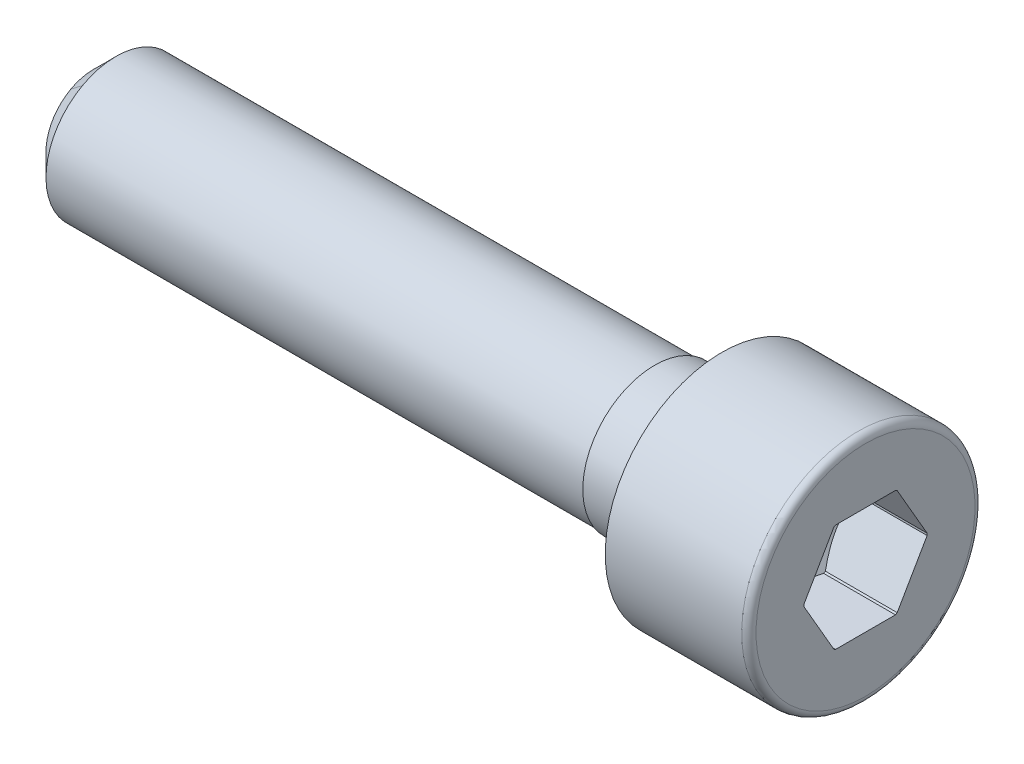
ISO-10303-21;
HEADER;
FILE_DESCRIPTION(('STEP AP214'),'2;1');
FILE_NAME('part.step','',(''),(''),'','','');
FILE_SCHEMA(('AUTOMOTIVE_DESIGN { 1 0 10303 214 1 1 1 1 }'));
ENDSEC;
DATA;
#1=APPLICATION_CONTEXT('core data for automotive mechanical design processes');
#2=APPLICATION_PROTOCOL_DEFINITION('international standard','automotive_design',2000,#1);
#3=PRODUCT_CONTEXT('',#1,'mechanical');
#4=PRODUCT('Part','Part','',(#3));
#5=PRODUCT_RELATED_PRODUCT_CATEGORY('part','',(#4));
#6=PRODUCT_DEFINITION_FORMATION('','',#4);
#7=PRODUCT_DEFINITION_CONTEXT('part definition',#1,'design');
#8=PRODUCT_DEFINITION('design','',#6,#7);
#9=PRODUCT_DEFINITION_SHAPE('','',#8);
#10=(LENGTH_UNIT() NAMED_UNIT(*) SI_UNIT(.MILLI.,.METRE.));
#11=(NAMED_UNIT(*) PLANE_ANGLE_UNIT() SI_UNIT($,.RADIAN.));
#12=(NAMED_UNIT(*) SI_UNIT($,.STERADIAN.) SOLID_ANGLE_UNIT());
#13=UNCERTAINTY_MEASURE_WITH_UNIT(LENGTH_MEASURE(1.E-05),#10,'distance_accuracy_value','');
#14=(GEOMETRIC_REPRESENTATION_CONTEXT(3) GLOBAL_UNCERTAINTY_ASSIGNED_CONTEXT((#13)) GLOBAL_UNIT_ASSIGNED_CONTEXT((#10,
#11,#12)) REPRESENTATION_CONTEXT('',''));
#15=CARTESIAN_POINT('',(0.,0.,0.));
#16=DIRECTION('',(0.,0.,1.));
#17=DIRECTION('',(1.,0.,0.));
#18=AXIS2_PLACEMENT_3D('',#15,#16,#17);
#19=CARTESIAN_POINT('',(5.00941127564,0.,0.));
#20=DIRECTION('',(-1.,0.,0.));
#21=DIRECTION('',(0.,0.,1.));
#22=AXIS2_PLACEMENT_3D('',#19,#20,#21);
#23=CYLINDRICAL_SURFACE('',#22,3.4315);
#24=DIRECTION('',(1.,0.,0.));
#25=VECTOR('',#24,1.);
#26=CARTESIAN_POINT('',(8.,3.,-1.66589082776));
#27=LINE('',#26,#25);
#28=CARTESIAN_POINT('',(4.00000000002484,3.,-1.66589082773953));
#29=VERTEX_POINT('',#28);
#30=CARTESIAN_POINT('',(8.,3.,-1.66589082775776));
#31=VERTEX_POINT('',#30);
#32=EDGE_CURVE('E152',#29,#31,#27,.T.);
#33=ORIENTED_EDGE('',*,*,#32,.F.);
#34=CARTESIAN_POINT('',(4.0000000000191,0.,0.));
#35=DIRECTION('',(1.,0.,0.));
#36=DIRECTION('',(0.,0.479425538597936,0.877582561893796));
#37=AXIS2_PLACEMENT_3D('',#34,#35,#36);
#38=CIRCLE('',#37,3.43149999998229);
#39=CARTESIAN_POINT('',(4.0000000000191,2.94270377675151,-1.76513079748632));
#40=VERTEX_POINT('',#39);
#41=EDGE_CURVE('E147',#29,#40,#38,.F.);
#42=ORIENTED_EDGE('',*,*,#41,.T.);
#43=DIRECTION('',(1.,0.,0.));
#44=VECTOR('',#43,1.);
#45=CARTESIAN_POINT('',(8.,2.94270377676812,-1.76513079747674));
#46=LINE('',#45,#44);
#47=CARTESIAN_POINT('',(8.,2.94270377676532,-1.76513079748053));
#48=VERTEX_POINT('',#47);
#49=EDGE_CURVE('E146',#48,#40,#46,.F.);
#50=ORIENTED_EDGE('',*,*,#49,.F.);
#51=CARTESIAN_POINT('',(8.,0.,0.));
#52=DIRECTION('',(1.,0.,0.));
#53=DIRECTION('',(0.,0.,-1.));
#54=AXIS2_PLACEMENT_3D('',#51,#52,#53);
#55=CIRCLE('',#54,3.4315);
#56=EDGE_CURVE('E131',#31,#48,#55,.F.);
#57=ORIENTED_EDGE('',*,*,#56,.F.);
#58=EDGE_LOOP('',(#33,#42,#50,#57));
#59=FACE_BOUND('',#58,.T.);
#60=ADVANCED_FACE('F16',(#59),#23,.F.);
#61=CARTESIAN_POINT('',(5.00941127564,0.,0.));
#62=DIRECTION('',(-1.,0.,0.));
#63=DIRECTION('',(0.,0.,1.));
#64=AXIS2_PLACEMENT_3D('',#61,#62,#63);
#65=CYLINDRICAL_SURFACE('',#64,3.4315);
#66=DIRECTION('',(1.,0.,0.));
#67=VECTOR('',#66,1.);
#68=CARTESIAN_POINT('',(8.,-0.0572962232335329,-3.43102162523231));
#69=LINE('',#68,#67);
#70=CARTESIAN_POINT('',(8.,-0.057296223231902,-3.43102162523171));
#71=VERTEX_POINT('',#70);
#72=CARTESIAN_POINT('',(4.0000000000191,-0.0572962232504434,-3.43102162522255));
#73=VERTEX_POINT('',#72);
#74=EDGE_CURVE('E375',#71,#73,#69,.F.);
#75=ORIENTED_EDGE('',*,*,#74,.F.);
#76=CARTESIAN_POINT('',(8.,0.,0.));
#77=DIRECTION('',(1.,0.,0.));
#78=DIRECTION('',(0.,0.,-1.));
#79=AXIS2_PLACEMENT_3D('',#76,#77,#78);
#80=CIRCLE('',#79,3.4315);
#81=CARTESIAN_POINT('',(8.,0.0572962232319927,-3.43102162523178));
#82=VERTEX_POINT('',#81);
#83=EDGE_CURVE('E143',#82,#71,#80,.F.);
#84=ORIENTED_EDGE('',*,*,#83,.F.);
#85=DIRECTION('',(1.,0.,0.));
#86=VECTOR('',#85,1.);
#87=CARTESIAN_POINT('',(8.,0.0572962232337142,-3.43102162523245));
#88=LINE('',#87,#86);
#89=CARTESIAN_POINT('',(4.00000000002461,0.0572962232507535,-3.43102162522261));
#90=VERTEX_POINT('',#89);
#91=EDGE_CURVE('E157',#90,#82,#88,.T.);
#92=ORIENTED_EDGE('',*,*,#91,.F.);
#93=CARTESIAN_POINT('',(4.0000000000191,0.,0.));
#94=DIRECTION('',(1.,0.,0.));
#95=DIRECTION('',(0.,0.479425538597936,0.877582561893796));
#96=AXIS2_PLACEMENT_3D('',#93,#94,#95);
#97=CIRCLE('',#96,3.43149999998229);
#98=EDGE_CURVE('E167',#90,#73,#97,.F.);
#99=ORIENTED_EDGE('',*,*,#98,.T.);
#100=EDGE_LOOP('',(#75,#84,#92,#99));
#101=FACE_BOUND('',#100,.T.);
#102=ADVANCED_FACE('F410',(#101),#65,.F.);
#103=CARTESIAN_POINT('',(5.00941127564,0.,0.));
#104=DIRECTION('',(-1.,0.,0.));
#105=DIRECTION('',(0.,0.,1.));
#106=AXIS2_PLACEMENT_3D('',#103,#104,#105);
#107=CYLINDRICAL_SURFACE('',#106,3.4315);
#108=CARTESIAN_POINT('',(4.0000000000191,0.,0.));
#109=DIRECTION('',(1.,0.,0.));
#110=DIRECTION('',(0.,0.479425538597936,0.877582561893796));
#111=AXIS2_PLACEMENT_3D('',#108,#109,#110);
#112=CIRCLE('',#111,3.43149999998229);
#113=CARTESIAN_POINT('',(4.00000000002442,-2.94270377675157,-1.76513079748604));
#114=VERTEX_POINT('',#113);
#115=CARTESIAN_POINT('',(4.0000000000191,-3.,-1.66589082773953));
#116=VERTEX_POINT('',#115);
#117=EDGE_CURVE('E269',#114,#116,#112,.F.);
#118=ORIENTED_EDGE('',*,*,#117,.T.);
#119=DIRECTION('',(1.,0.,0.));
#120=VECTOR('',#119,1.);
#121=CARTESIAN_POINT('',(8.,-3.,-1.66589082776));
#122=LINE('',#121,#120);
#123=CARTESIAN_POINT('',(8.,-3.,-1.66589082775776));
#124=VERTEX_POINT('',#123);
#125=EDGE_CURVE('E240',#124,#116,#122,.F.);
#126=ORIENTED_EDGE('',*,*,#125,.F.);
#127=CARTESIAN_POINT('',(8.,0.,0.));
#128=DIRECTION('',(1.,0.,0.));
#129=DIRECTION('',(0.,0.,-1.));
#130=AXIS2_PLACEMENT_3D('',#127,#128,#129);
#131=CIRCLE('',#130,3.4315);
#132=CARTESIAN_POINT('',(8.,-2.94270377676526,-1.76513079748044));
#133=VERTEX_POINT('',#132);
#134=EDGE_CURVE('E272',#133,#124,#131,.F.);
#135=ORIENTED_EDGE('',*,*,#134,.F.);
#136=DIRECTION('',(1.,0.,0.));
#137=VECTOR('',#136,1.);
#138=CARTESIAN_POINT('',(8.,-2.94270377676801,-1.76513079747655));
#139=LINE('',#138,#137);
#140=EDGE_CURVE('E372',#114,#133,#139,.T.);
#141=ORIENTED_EDGE('',*,*,#140,.F.);
#142=EDGE_LOOP('',(#118,#126,#135,#141));
#143=FACE_BOUND('',#142,.T.);
#144=ADVANCED_FACE('F399',(#143),#107,.F.);
#145=CARTESIAN_POINT('',(5.00941127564,0.,0.));
#146=DIRECTION('',(-1.,0.,0.));
#147=DIRECTION('',(0.,0.,1.));
#148=AXIS2_PLACEMENT_3D('',#145,#146,#147);
#149=CYLINDRICAL_SURFACE('',#148,3.4315);
#150=DIRECTION('',(1.,0.,0.));
#151=VECTOR('',#150,1.);
#152=CARTESIAN_POINT('',(8.,-3.,1.66589082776));
#153=LINE('',#152,#151);
#154=CARTESIAN_POINT('',(4.00000000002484,-3.,1.66589082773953));
#155=VERTEX_POINT('',#154);
#156=CARTESIAN_POINT('',(8.,-3.,1.66589082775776));
#157=VERTEX_POINT('',#156);
#158=EDGE_CURVE('E239',#155,#157,#153,.T.);
#159=ORIENTED_EDGE('',*,*,#158,.F.);
#160=CARTESIAN_POINT('',(4.0000000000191,0.,0.));
#161=DIRECTION('',(1.,0.,0.));
#162=DIRECTION('',(0.,0.479425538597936,0.877582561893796));
#163=AXIS2_PLACEMENT_3D('',#160,#161,#162);
#164=CIRCLE('',#163,3.43149999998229);
#165=CARTESIAN_POINT('',(4.0000000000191,-2.94270377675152,1.76513079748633));
#166=VERTEX_POINT('',#165);
#167=EDGE_CURVE('E389',#155,#166,#164,.F.);
#168=ORIENTED_EDGE('',*,*,#167,.T.);
#169=DIRECTION('',(1.,0.,0.));
#170=VECTOR('',#169,1.);
#171=CARTESIAN_POINT('',(8.,-2.94270377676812,1.76513079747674));
#172=LINE('',#171,#170);
#173=CARTESIAN_POINT('',(8.,-2.94270377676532,1.76513079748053));
#174=VERTEX_POINT('',#173);
#175=EDGE_CURVE('E365',#174,#166,#172,.F.);
#176=ORIENTED_EDGE('',*,*,#175,.F.);
#177=CARTESIAN_POINT('',(8.,0.,0.));
#178=DIRECTION('',(1.,0.,0.));
#179=DIRECTION('',(0.,0.,-1.));
#180=AXIS2_PLACEMENT_3D('',#177,#178,#179);
#181=CIRCLE('',#180,3.4315);
#182=EDGE_CURVE('E270',#157,#174,#181,.F.);
#183=ORIENTED_EDGE('',*,*,#182,.F.);
#184=EDGE_LOOP('',(#159,#168,#176,#183));
#185=FACE_BOUND('',#184,.T.);
#186=ADVANCED_FACE('F424',(#185),#149,.F.);
#187=CARTESIAN_POINT('',(5.00941127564,0.,0.));
#188=DIRECTION('',(-1.,0.,0.));
#189=DIRECTION('',(0.,0.,1.));
#190=AXIS2_PLACEMENT_3D('',#187,#188,#189);
#191=CYLINDRICAL_SURFACE('',#190,3.4315);
#192=DIRECTION('',(1.,0.,0.));
#193=VECTOR('',#192,1.);
#194=CARTESIAN_POINT('',(8.,0.0572962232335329,3.43102162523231));
#195=LINE('',#194,#193);
#196=CARTESIAN_POINT('',(8.,0.057296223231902,3.43102162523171));
#197=VERTEX_POINT('',#196);
#198=CARTESIAN_POINT('',(4.0000000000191,0.0572962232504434,3.43102162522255));
#199=VERTEX_POINT('',#198);
#200=EDGE_CURVE('E196',#197,#199,#195,.F.);
#201=ORIENTED_EDGE('',*,*,#200,.F.);
#202=CARTESIAN_POINT('',(8.,0.,0.));
#203=DIRECTION('',(1.,0.,0.));
#204=DIRECTION('',(0.,0.,-1.));
#205=AXIS2_PLACEMENT_3D('',#202,#203,#204);
#206=CIRCLE('',#205,3.4315);
#207=CARTESIAN_POINT('',(8.,-0.0572962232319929,3.43102162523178));
#208=VERTEX_POINT('',#207);
#209=EDGE_CURVE('E267',#208,#197,#206,.F.);
#210=ORIENTED_EDGE('',*,*,#209,.F.);
#211=DIRECTION('',(1.,0.,0.));
#212=VECTOR('',#211,1.);
#213=CARTESIAN_POINT('',(8.,-0.0572962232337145,3.43102162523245));
#214=LINE('',#213,#212);
#215=CARTESIAN_POINT('',(4.00000000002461,-0.057296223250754,3.43102162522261));
#216=VERTEX_POINT('',#215);
#217=EDGE_CURVE('E362',#216,#208,#214,.T.);
#218=ORIENTED_EDGE('',*,*,#217,.F.);
#219=CARTESIAN_POINT('',(4.0000000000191,0.,0.));
#220=DIRECTION('',(1.,0.,0.));
#221=DIRECTION('',(0.,0.479425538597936,0.877582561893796));
#222=AXIS2_PLACEMENT_3D('',#219,#220,#221);
#223=CIRCLE('',#222,3.43149999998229);
#224=EDGE_CURVE('E168',#216,#199,#223,.F.);
#225=ORIENTED_EDGE('',*,*,#224,.T.);
#226=EDGE_LOOP('',(#201,#210,#218,#225));
#227=FACE_BOUND('',#226,.T.);
#228=ADVANCED_FACE('F212',(#227),#191,.F.);
#229=CARTESIAN_POINT('',(4.0000000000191,0.,0.));
#230=DIRECTION('',(1.,0.,0.));
#231=DIRECTION('',(0.,0.,-1.));
#232=AXIS2_PLACEMENT_3D('',#229,#230,#231);
#233=CONICAL_SURFACE('',#232,3.43149999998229,1.0471975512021);
#234=CARTESIAN_POINT('',(2.02219020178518,-3.92209341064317E-12,2.14264945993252E-12));
#235=VERTEX_POINT('',#234);
#236=VERTEX_LOOP('',#235);
#237=FACE_BOUND('',#236,.T.);
#238=CARTESIAN_POINT('',(4.00000000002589,0.0572962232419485,3.43102162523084));
#239=CARTESIAN_POINT('',(3.96325492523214,0.17081183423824,3.36548335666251));
#240=CARTESIAN_POINT('',(3.929566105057,0.28514686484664,3.29947199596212));
#241=CARTESIAN_POINT('',(3.86970967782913,0.515490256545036,3.16648317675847));
#242=CARTESIAN_POINT('',(3.8435558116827,0.631501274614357,3.09950418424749));
#243=CARTESIAN_POINT('',(3.80077359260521,0.862380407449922,2.96620605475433));
#244=CARTESIAN_POINT('',(3.78395759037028,0.977221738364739,2.899902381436));
#245=CARTESIAN_POINT('',(3.76016083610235,1.20757941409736,2.76690531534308));
#246=CARTESIAN_POINT('',(3.75317159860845,1.32309508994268,2.70021230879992));
#247=CARTESIAN_POINT('',(3.74938304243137,1.56424529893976,2.56098417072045));
#248=CARTESIAN_POINT('',(3.75351627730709,1.68989180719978,2.48844212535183));
#249=CARTESIAN_POINT('',(3.77363673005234,1.94058202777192,2.34370605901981));
#250=CARTESIAN_POINT('',(3.78963616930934,2.06562498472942,2.2715124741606));
#251=CARTESIAN_POINT('',(3.83267808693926,2.31719015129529,2.1262712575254));
#252=CARTESIAN_POINT('',(3.85996753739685,2.4436796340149,2.05324252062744));
#253=CARTESIAN_POINT('',(3.92364198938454,2.69467514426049,1.90833019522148));
#254=CARTESIAN_POINT('',(3.96000827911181,2.81918469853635,1.83644457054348));
#255=CARTESIAN_POINT('',(4.00000000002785,2.94270377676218,1.76513079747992));
#256=B_SPLINE_CURVE_WITH_KNOTS('',3,(#238,#239,#240,#241,#242,#243,#244,#245,#246,#247,#248,
#249,#250,#251,#252,#253,#254,#255),.UNSPECIFIED.,.F.,.F.,(4,2,2,2,2,2,2,2,4),(0.,
0.408481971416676,0.817704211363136,1.21837417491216,1.61869794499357,2.05360864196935,
2.48896789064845,2.93440148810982,3.3789243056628),.UNSPECIFIED.);
#257=CARTESIAN_POINT('',(4.00000000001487,2.94270377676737,1.76513079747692));
#258=VERTEX_POINT('',#257);
#259=EDGE_CURVE('E188',#199,#258,#256,.T.);
#260=ORIENTED_EDGE('',*,*,#259,.F.);
#261=ORIENTED_EDGE('',*,*,#224,.F.);
#262=CARTESIAN_POINT('',(4.00000000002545,-2.94270377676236,1.76513079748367));
#263=CARTESIAN_POINT('',(3.95761571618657,-2.8118234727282,1.84069457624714));
#264=CARTESIAN_POINT('',(3.9193099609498,-2.67981268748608,1.9169110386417));
#265=CARTESIAN_POINT('',(3.85299680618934,-2.41358638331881,2.07061686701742));
#266=CARTESIAN_POINT('',(3.82501189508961,-2.27936670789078,2.14810863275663));
#267=CARTESIAN_POINT('',(3.78220050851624,-2.01256396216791,2.30214726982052));
#268=CARTESIAN_POINT('',(3.76707654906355,-1.88001803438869,2.37867269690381));
#269=CARTESIAN_POINT('',(3.75031731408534,-1.61441682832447,2.53201762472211));
#270=CARTESIAN_POINT('',(3.74866675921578,-1.4813622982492,2.60883669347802));
#271=CARTESIAN_POINT('',(3.75800702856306,-1.240344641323,2.7479883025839));
#272=CARTESIAN_POINT('',(3.76670796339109,-1.13230895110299,2.81036273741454));
#273=CARTESIAN_POINT('',(3.79254998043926,-0.916926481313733,2.93471386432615));
#274=CARTESIAN_POINT('',(3.80969720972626,-0.809580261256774,2.99669023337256));
#275=CARTESIAN_POINT('',(3.8518773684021,-0.593876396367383,3.12122691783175));
#276=CARTESIAN_POINT('',(3.8770609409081,-0.485541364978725,3.18377417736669));
#277=CARTESIAN_POINT('',(3.93394629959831,-0.270335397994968,3.30802340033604));
#278=CARTESIAN_POINT('',(3.96563762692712,-0.163462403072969,3.36972655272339));
#279=CARTESIAN_POINT('',(4.00000000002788,-0.0572962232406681,3.43102162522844));
#280=B_SPLINE_CURVE_WITH_KNOTS('',3,(#262,#263,#264,#265,#266,#267,#268,#269,#270,#271,#272,
#273,#274,#275,#276,#277,#278,#279),.UNSPECIFIED.,.F.,.F.,(4,2,2,2,2,2,2,2,4),(0.,
0.471055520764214,0.943131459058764,1.40396540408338,1.86427667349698,2.23913478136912,
2.61426610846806,2.99688901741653,3.37890174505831),.UNSPECIFIED.);
#281=EDGE_CURVE('E197',#166,#216,#280,.T.);
#282=ORIENTED_EDGE('',*,*,#281,.F.);
#283=ORIENTED_EDGE('',*,*,#167,.F.);
#284=CARTESIAN_POINT('',(4.00000000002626,-3.000000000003,-1.66589082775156));
#285=CARTESIAN_POINT('',(3.95761571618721,-3.00000000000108,-1.51476327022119));
#286=CARTESIAN_POINT('',(3.91930996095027,-3.00000000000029,-1.36233034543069));
#287=CARTESIAN_POINT('',(3.85299680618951,-2.99999999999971,-1.05491868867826));
#288=CARTESIAN_POINT('',(3.82501189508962,-2.99999999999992,-0.899935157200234));
#289=CARTESIAN_POINT('',(3.78220050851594,-3.00000000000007,-0.591857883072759));
#290=CARTESIAN_POINT('',(3.76707654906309,-3.00000000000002,-0.438807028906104));
#291=CARTESIAN_POINT('',(3.75031731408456,-2.99999999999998,-0.132117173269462));
#292=CARTESIAN_POINT('',(3.74866675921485,-2.99999999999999,0.0215209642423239));
#293=CARTESIAN_POINT('',(3.75800702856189,-3.,0.299824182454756));
#294=CARTESIAN_POINT('',(3.76670796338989,-3.,0.424573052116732));
#295=CARTESIAN_POINT('',(3.79254998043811,-3.,0.673275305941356));
#296=CARTESIAN_POINT('',(3.80969720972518,-3.,0.797228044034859));
#297=CARTESIAN_POINT('',(3.85187736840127,-3.,1.04630141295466));
#298=CARTESIAN_POINT('',(3.87706094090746,-3.,1.17139593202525));
#299=CARTESIAN_POINT('',(3.93394629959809,-3.,1.41989437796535));
#300=CARTESIAN_POINT('',(3.96563762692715,-3.,1.54330068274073));
#301=CARTESIAN_POINT('',(4.00000000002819,-3.,1.6658908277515));
#302=B_SPLINE_CURVE_WITH_KNOTS('',3,(#284,#285,#286,#287,#288,#289,#290,#291,#292,#293,#294,
#295,#296,#297,#298,#299,#300,#301),.UNSPECIFIED.,.F.,.F.,(4,2,2,2,2,2,2,2,4),(0.,
0.471055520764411,0.943131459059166,1.40396540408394,1.86427667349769,2.23913478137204,
2.61426610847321,2.99688901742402,3.37890174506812),.UNSPECIFIED.);
#303=EDGE_CURVE('E233',#116,#155,#302,.T.);
#304=ORIENTED_EDGE('',*,*,#303,.F.);
#305=ORIENTED_EDGE('',*,*,#117,.F.);
#306=CARTESIAN_POINT('',(4.00000000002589,-0.0572962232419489,-3.43102162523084));
#307=CARTESIAN_POINT('',(3.96325492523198,-0.170811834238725,-3.36548335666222));
#308=CARTESIAN_POINT('',(3.92956610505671,-0.285146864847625,-3.29947199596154));
#309=CARTESIAN_POINT('',(3.86970967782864,-0.515490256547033,-3.16648317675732));
#310=CARTESIAN_POINT('',(3.84355581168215,-0.631501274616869,-3.09950418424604));
#311=CARTESIAN_POINT('',(3.80077359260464,-0.862380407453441,-2.96620605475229));
#312=CARTESIAN_POINT('',(3.78395759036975,-0.977221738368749,-2.89990238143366));
#313=CARTESIAN_POINT('',(3.76016083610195,-1.20757941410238,-2.7669053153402));
#314=CARTESIAN_POINT('',(3.75317159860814,-1.32309508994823,-2.70021230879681));
#315=CARTESIAN_POINT('',(3.74938304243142,-1.5642452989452,-2.56098417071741));
#316=CARTESIAN_POINT('',(3.75351627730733,-1.68989180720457,-2.4884421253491));
#317=CARTESIAN_POINT('',(3.77363673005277,-1.94058202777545,-2.34370605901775));
#318=CARTESIAN_POINT('',(3.78963616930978,-2.06562498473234,-2.27151247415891));
#319=CARTESIAN_POINT('',(3.83267808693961,-2.31719015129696,-2.12627125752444));
#320=CARTESIAN_POINT('',(3.8599675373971,-2.44367963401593,-2.05324252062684));
#321=CARTESIAN_POINT('',(3.92364198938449,-2.69467514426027,-1.9083301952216));
#322=CARTESIAN_POINT('',(3.96000827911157,-2.81918469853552,-1.83644457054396));
#323=CARTESIAN_POINT('',(4.00000000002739,-2.94270377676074,-1.76513079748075));
#324=B_SPLINE_CURVE_WITH_KNOTS('',3,(#306,#307,#308,#309,#310,#311,#312,#313,#314,#315,#316,
#317,#318,#319,#320,#321,#322,#323),.UNSPECIFIED.,.F.,.F.,(4,2,2,2,2,2,2,2,4),(0.,
0.408481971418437,0.817704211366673,1.2183741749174,1.6186979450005,2.05360864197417,
2.48896789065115,2.93440148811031,3.37892430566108),.UNSPECIFIED.);
#325=EDGE_CURVE('E228',#73,#114,#324,.T.);
#326=ORIENTED_EDGE('',*,*,#325,.F.);
#327=ORIENTED_EDGE('',*,*,#98,.F.);
#328=CARTESIAN_POINT('',(4.00000000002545,2.94270377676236,-1.76513079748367));
#329=CARTESIAN_POINT('',(3.95761571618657,2.8118234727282,-1.84069457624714));
#330=CARTESIAN_POINT('',(3.91930996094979,2.67981268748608,-1.9169110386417));
#331=CARTESIAN_POINT('',(3.85299680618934,2.41358638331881,-2.07061686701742));
#332=CARTESIAN_POINT('',(3.82501189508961,2.27936670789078,-2.14810863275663));
#333=CARTESIAN_POINT('',(3.78220050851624,2.0125639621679,-2.30214726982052));
#334=CARTESIAN_POINT('',(3.76707654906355,1.88001803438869,-2.37867269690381));
#335=CARTESIAN_POINT('',(3.75031731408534,1.61441682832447,-2.53201762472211));
#336=CARTESIAN_POINT('',(3.74866675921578,1.4813622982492,-2.60883669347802));
#337=CARTESIAN_POINT('',(3.75800702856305,1.240344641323,-2.7479883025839));
#338=CARTESIAN_POINT('',(3.76670796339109,1.13230895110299,-2.81036273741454));
#339=CARTESIAN_POINT('',(3.79254998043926,0.916926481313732,-2.93471386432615));
#340=CARTESIAN_POINT('',(3.80969720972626,0.809580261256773,-2.99669023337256));
#341=CARTESIAN_POINT('',(3.8518773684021,0.593876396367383,-3.12122691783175));
#342=CARTESIAN_POINT('',(3.8770609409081,0.485541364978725,-3.18377417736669));
#343=CARTESIAN_POINT('',(3.93394629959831,0.270335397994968,-3.30802340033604));
#344=CARTESIAN_POINT('',(3.96563762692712,0.163462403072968,-3.36972655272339));
#345=CARTESIAN_POINT('',(4.00000000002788,0.0572962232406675,-3.43102162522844));
#346=B_SPLINE_CURVE_WITH_KNOTS('',3,(#328,#329,#330,#331,#332,#333,#334,#335,#336,#337,#338,
#339,#340,#341,#342,#343,#344,#345),.UNSPECIFIED.,.F.,.F.,(4,2,2,2,2,2,2,2,4),(0.,
0.471055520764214,0.943131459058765,1.40396540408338,1.86427667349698,2.23913478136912,
2.61426610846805,2.99688901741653,3.37890174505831),.UNSPECIFIED.);
#347=EDGE_CURVE('E151',#40,#90,#346,.T.);
#348=ORIENTED_EDGE('',*,*,#347,.F.);
#349=ORIENTED_EDGE('',*,*,#41,.F.);
#350=CARTESIAN_POINT('',(4.00000000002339,3.00000000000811,1.66589082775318));
#351=CARTESIAN_POINT('',(3.95761571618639,3.00000000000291,1.51476327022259));
#352=CARTESIAN_POINT('',(3.91930996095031,3.00000000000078,1.36233034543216));
#353=CARTESIAN_POINT('',(3.85299680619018,2.99999999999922,1.05491868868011));
#354=CARTESIAN_POINT('',(3.82501189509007,2.99999999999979,0.899935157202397));
#355=CARTESIAN_POINT('',(3.78220050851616,3.0000000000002,0.591857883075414));
#356=CARTESIAN_POINT('',(3.76707654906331,3.00000000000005,0.438807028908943));
#357=CARTESIAN_POINT('',(3.75031731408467,2.99999999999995,0.132117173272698));
#358=CARTESIAN_POINT('',(3.74866675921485,2.99999999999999,-0.021520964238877));
#359=CARTESIAN_POINT('',(3.75800702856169,3.00000000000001,-0.299824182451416));
#360=CARTESIAN_POINT('',(3.76670796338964,3.,-0.424573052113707));
#361=CARTESIAN_POINT('',(3.7925499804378,3.,-0.673275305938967));
#362=CARTESIAN_POINT('',(3.80969720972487,3.,-0.797228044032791));
#363=CARTESIAN_POINT('',(3.85187736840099,3.,-1.04630141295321));
#364=CARTESIAN_POINT('',(3.87706094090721,3.,-1.1713959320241));
#365=CARTESIAN_POINT('',(3.93394629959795,3.,-1.41989437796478));
#366=CARTESIAN_POINT('',(3.96563762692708,3.,-1.54330068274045));
#367=CARTESIAN_POINT('',(4.00000000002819,3.,-1.6658908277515));
#368=B_SPLINE_CURVE_WITH_KNOTS('',3,(#350,#351,#352,#353,#354,#355,#356,#357,#358,#359,#360,
#361,#362,#363,#364,#365,#366,#367),.UNSPECIFIED.,.F.,.F.,(4,2,2,2,2,2,2,2,4),(0.,
0.471055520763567,0.943131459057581,1.40396540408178,1.86427667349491,2.23913478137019,
2.61426610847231,2.99688901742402,3.378901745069),.UNSPECIFIED.);
#369=CARTESIAN_POINT('',(4.00000000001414,3.,1.6658908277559));
#370=VERTEX_POINT('',#369);
#371=EDGE_CURVE('E257',#370,#29,#368,.T.);
#372=ORIENTED_EDGE('',*,*,#371,.F.);
#373=CARTESIAN_POINT('',(4.,0.,0.));
#374=DIRECTION('',(-1.,0.,0.));
#375=DIRECTION('',(0.,0.,1.));
#376=AXIS2_PLACEMENT_3D('',#373,#374,#375);
#377=CIRCLE('',#376,3.4315);
#378=EDGE_CURVE('E266',#370,#258,#377,.F.);
#379=ORIENTED_EDGE('',*,*,#378,.T.);
#380=EDGE_LOOP('',(#260,#261,#282,#283,#304,#305,#326,#327,#348,#349,#372,#379));
#381=FACE_BOUND('',#380,.T.);
#382=ADVANCED_FACE('F206',(#237,#381),#233,.F.);
#383=CARTESIAN_POINT('',(5.00941127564,0.,0.));
#384=DIRECTION('',(-1.,0.,0.));
#385=DIRECTION('',(0.,0.,1.));
#386=AXIS2_PLACEMENT_3D('',#383,#384,#385);
#387=CYLINDRICAL_SURFACE('',#386,3.4315);
#388=ORIENTED_EDGE('',*,*,#378,.F.);
#389=DIRECTION('',(1.,0.,0.));
#390=VECTOR('',#389,1.);
#391=CARTESIAN_POINT('',(8.,3.,1.66589082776));
#392=LINE('',#391,#390);
#393=CARTESIAN_POINT('',(8.,3.,1.66589082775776));
#394=VERTEX_POINT('',#393);
#395=EDGE_CURVE('E263',#394,#370,#392,.F.);
#396=ORIENTED_EDGE('',*,*,#395,.F.);
#397=CARTESIAN_POINT('',(8.,0.,0.));
#398=DIRECTION('',(1.,0.,0.));
#399=DIRECTION('',(0.,0.,-1.));
#400=AXIS2_PLACEMENT_3D('',#397,#398,#399);
#401=CIRCLE('',#400,3.4315);
#402=CARTESIAN_POINT('',(8.,2.94270377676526,1.76513079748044));
#403=VERTEX_POINT('',#402);
#404=EDGE_CURVE('E264',#403,#394,#401,.F.);
#405=ORIENTED_EDGE('',*,*,#404,.F.);
#406=DIRECTION('',(1.,0.,0.));
#407=VECTOR('',#406,1.);
#408=CARTESIAN_POINT('',(8.,2.94270377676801,1.76513079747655));
#409=LINE('',#408,#407);
#410=EDGE_CURVE('E163',#258,#403,#409,.T.);
#411=ORIENTED_EDGE('',*,*,#410,.F.);
#412=EDGE_LOOP('',(#388,#396,#405,#411));
#413=FACE_BOUND('',#412,.T.);
#414=ADVANCED_FACE('F211',(#413),#387,.F.);
#415=CARTESIAN_POINT('',(8.,3.,-1.73205080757));
#416=DIRECTION('',(0.,-1.,0.));
#417=DIRECTION('',(0.,0.,-1.));
#418=AXIS2_PLACEMENT_3D('',#415,#416,#417);
#419=PLANE('',#418);
#420=ORIENTED_EDGE('',*,*,#371,.T.);
#421=ORIENTED_EDGE('',*,*,#32,.T.);
#422=DIRECTION('',(0.,0.,-1.));
#423=VECTOR('',#422,1.);
#424=CARTESIAN_POINT('',(8.,3.,0.));
#425=LINE('',#424,#423);
#426=EDGE_CURVE('E142',#394,#31,#425,.T.);
#427=ORIENTED_EDGE('',*,*,#426,.F.);
#428=ORIENTED_EDGE('',*,*,#395,.T.);
#429=EDGE_LOOP('',(#420,#421,#427,#428));
#430=FACE_BOUND('',#429,.T.);
#431=ADVANCED_FACE('F253',(#430),#419,.T.);
#432=CARTESIAN_POINT('',(8.,0.,-3.46410161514));
#433=DIRECTION('',(0.,-0.50000000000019,0.866025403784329));
#434=DIRECTION('',(0.,-0.866025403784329,-0.50000000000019));
#435=AXIS2_PLACEMENT_3D('',#432,#433,#434);
#436=PLANE('',#435);
#437=ORIENTED_EDGE('',*,*,#347,.T.);
#438=ORIENTED_EDGE('',*,*,#91,.T.);
#439=DIRECTION('',(0.,-0.866025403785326,-0.499999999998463));
#440=VECTOR('',#439,1.);
#441=CARTESIAN_POINT('',(8.,2.94270377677,-1.76513079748));
#442=LINE('',#441,#440);
#443=EDGE_CURVE('E140',#48,#82,#442,.T.);
#444=ORIENTED_EDGE('',*,*,#443,.F.);
#445=ORIENTED_EDGE('',*,*,#49,.T.);
#446=EDGE_LOOP('',(#437,#438,#444,#445));
#447=FACE_BOUND('',#446,.T.);
#448=ADVANCED_FACE('F155',(#447),#436,.T.);
#449=CARTESIAN_POINT('',(8.,-3.,-1.73205080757));
#450=DIRECTION('',(0.,0.50000000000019,0.866025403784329));
#451=DIRECTION('',(0.,-0.866025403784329,0.50000000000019));
#452=AXIS2_PLACEMENT_3D('',#449,#450,#451);
#453=PLANE('',#452);
#454=ORIENTED_EDGE('',*,*,#325,.T.);
#455=ORIENTED_EDGE('',*,*,#140,.T.);
#456=DIRECTION('',(0.,-0.866025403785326,0.499999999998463));
#457=VECTOR('',#456,1.);
#458=CARTESIAN_POINT('',(8.,-0.0572962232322,-3.43102162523));
#459=LINE('',#458,#457);
#460=EDGE_CURVE('E158',#71,#133,#459,.T.);
#461=ORIENTED_EDGE('',*,*,#460,.F.);
#462=ORIENTED_EDGE('',*,*,#74,.T.);
#463=EDGE_LOOP('',(#454,#455,#461,#462));
#464=FACE_BOUND('',#463,.T.);
#465=ADVANCED_FACE('F245',(#464),#453,.T.);
#466=CARTESIAN_POINT('',(8.,-3.,1.73205080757));
#467=DIRECTION('',(0.,1.,0.));
#468=DIRECTION('',(0.,0.,1.));
#469=AXIS2_PLACEMENT_3D('',#466,#467,#468);
#470=PLANE('',#469);
#471=ORIENTED_EDGE('',*,*,#303,.T.);
#472=ORIENTED_EDGE('',*,*,#158,.T.);
#473=DIRECTION('',(0.,0.,-1.));
#474=VECTOR('',#473,1.);
#475=CARTESIAN_POINT('',(8.,-3.,0.));
#476=LINE('',#475,#474);
#477=EDGE_CURVE('E161',#124,#157,#476,.F.);
#478=ORIENTED_EDGE('',*,*,#477,.F.);
#479=ORIENTED_EDGE('',*,*,#125,.T.);
#480=EDGE_LOOP('',(#471,#472,#478,#479));
#481=FACE_BOUND('',#480,.T.);
#482=ADVANCED_FACE('F241',(#481),#470,.T.);
#483=CARTESIAN_POINT('',(8.,0.,3.46410161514));
#484=DIRECTION('',(0.,0.50000000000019,-0.866025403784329));
#485=DIRECTION('',(0.,0.866025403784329,0.50000000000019));
#486=AXIS2_PLACEMENT_3D('',#483,#484,#485);
#487=PLANE('',#486);
#488=ORIENTED_EDGE('',*,*,#281,.T.);
#489=ORIENTED_EDGE('',*,*,#217,.T.);
#490=DIRECTION('',(0.,0.866025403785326,0.499999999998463));
#491=VECTOR('',#490,1.);
#492=CARTESIAN_POINT('',(8.,-2.94270377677,1.76513079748));
#493=LINE('',#492,#491);
#494=EDGE_CURVE('E386',#174,#208,#493,.T.);
#495=ORIENTED_EDGE('',*,*,#494,.F.);
#496=ORIENTED_EDGE('',*,*,#175,.T.);
#497=EDGE_LOOP('',(#488,#489,#495,#496));
#498=FACE_BOUND('',#497,.T.);
#499=ADVANCED_FACE('F244',(#498),#487,.T.);
#500=CARTESIAN_POINT('',(8.,3.,1.73205080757));
#501=DIRECTION('',(0.,-0.50000000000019,-0.866025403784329));
#502=DIRECTION('',(0.,0.866025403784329,-0.50000000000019));
#503=AXIS2_PLACEMENT_3D('',#500,#501,#502);
#504=PLANE('',#503);
#505=ORIENTED_EDGE('',*,*,#259,.T.);
#506=ORIENTED_EDGE('',*,*,#410,.T.);
#507=DIRECTION('',(0.,0.866025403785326,-0.499999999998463));
#508=VECTOR('',#507,1.);
#509=CARTESIAN_POINT('',(8.,0.0572962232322,3.43102162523));
#510=LINE('',#509,#508);
#511=EDGE_CURVE('E383',#197,#403,#510,.T.);
#512=ORIENTED_EDGE('',*,*,#511,.F.);
#513=ORIENTED_EDGE('',*,*,#200,.T.);
#514=EDGE_LOOP('',(#505,#506,#512,#513));
#515=FACE_BOUND('',#514,.T.);
#516=ADVANCED_FACE('F203',(#515),#504,.T.);
#517=CARTESIAN_POINT('',(8.,0.,0.));
#518=DIRECTION('',(1.,0.,0.));
#519=DIRECTION('',(0.,0.,-1.));
#520=AXIS2_PLACEMENT_3D('',#517,#518,#519);
#521=PLANE('',#520);
#522=ORIENTED_EDGE('',*,*,#511,.T.);
#523=ORIENTED_EDGE('',*,*,#404,.T.);
#524=ORIENTED_EDGE('',*,*,#426,.T.);
#525=ORIENTED_EDGE('',*,*,#56,.T.);
#526=ORIENTED_EDGE('',*,*,#443,.T.);
#527=ORIENTED_EDGE('',*,*,#83,.T.);
#528=ORIENTED_EDGE('',*,*,#460,.T.);
#529=ORIENTED_EDGE('',*,*,#134,.T.);
#530=ORIENTED_EDGE('',*,*,#477,.T.);
#531=ORIENTED_EDGE('',*,*,#182,.T.);
#532=ORIENTED_EDGE('',*,*,#494,.T.);
#533=ORIENTED_EDGE('',*,*,#209,.T.);
#534=EDGE_LOOP('',(#522,#523,#524,#525,#526,#527,#528,#529,#530,#531,#532,#533));
#535=FACE_BOUND('',#534,.T.);
#536=CARTESIAN_POINT('',(8.,0.,0.));
#537=DIRECTION('',(-1.,0.,0.));
#538=DIRECTION('',(0.,1.,0.));
#539=AXIS2_PLACEMENT_3D('',#536,#537,#538);
#540=CIRCLE('',#539,6.1);
#541=CARTESIAN_POINT('',(8.,6.1,0.));
#542=VERTEX_POINT('',#541);
#543=CARTESIAN_POINT('',(8.,-6.1,0.));
#544=VERTEX_POINT('',#543);
#545=EDGE_CURVE('E636',#542,#544,#540,.T.);
#546=ORIENTED_EDGE('',*,*,#545,.F.);
#547=CARTESIAN_POINT('',(8.,0.,0.));
#548=DIRECTION('',(-1.,0.,0.));
#549=DIRECTION('',(0.,-1.,0.));
#550=AXIS2_PLACEMENT_3D('',#547,#548,#549);
#551=CIRCLE('',#550,6.1);
#552=EDGE_CURVE('E385',#544,#542,#551,.T.);
#553=ORIENTED_EDGE('',*,*,#552,.F.);
#554=EDGE_LOOP('',(#546,#553));
#555=FACE_BOUND('',#554,.T.);
#556=ADVANCED_FACE('F137',(#535,#555),#521,.T.);
#557=CARTESIAN_POINT('',(7.6,0.,0.));
#558=DIRECTION('',(1.,0.,0.));
#559=DIRECTION('',(0.,-0.982387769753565,0.186853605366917));
#560=AXIS2_PLACEMENT_3D('',#557,#558,#559);
#561=TOROIDAL_SURFACE('',#560,6.1,0.4);
#562=CARTESIAN_POINT('',(7.6,0.,0.));
#563=DIRECTION('',(1.,0.,0.));
#564=DIRECTION('',(0.,0.,-1.));
#565=AXIS2_PLACEMENT_3D('',#562,#563,#564);
#566=CIRCLE('',#565,6.5);
#567=CARTESIAN_POINT('',(7.6,0.,-6.5));
#568=VERTEX_POINT('',#567);
#569=EDGE_CURVE('E187',#568,#568,#566,.F.);
#570=ORIENTED_EDGE('',*,*,#569,.F.);
#571=EDGE_LOOP('',(#570));
#572=FACE_BOUND('',#571,.T.);
#573=ORIENTED_EDGE('',*,*,#545,.T.);
#574=ORIENTED_EDGE('',*,*,#552,.T.);
#575=EDGE_LOOP('',(#573,#574));
#576=FACE_BOUND('',#575,.T.);
#577=ADVANCED_FACE('F339',(#572,#576),#561,.T.);
#578=CARTESIAN_POINT('',(4.,0.,0.));
#579=DIRECTION('',(1.,0.,0.));
#580=DIRECTION('',(0.,0.,-1.));
#581=AXIS2_PLACEMENT_3D('',#578,#579,#580);
#582=CYLINDRICAL_SURFACE('',#581,6.5);
#583=CARTESIAN_POINT('',(0.,0.,0.));
#584=DIRECTION('',(1.,0.,0.));
#585=DIRECTION('',(0.,0.,-1.));
#586=AXIS2_PLACEMENT_3D('',#583,#584,#585);
#587=CIRCLE('',#586,6.5);
#588=CARTESIAN_POINT('',(0.,0.,-6.5));
#589=VERTEX_POINT('',#588);
#590=EDGE_CURVE('E183',#589,#589,#587,.T.);
#591=ORIENTED_EDGE('',*,*,#590,.T.);
#592=EDGE_LOOP('',(#591));
#593=FACE_BOUND('',#592,.T.);
#594=ORIENTED_EDGE('',*,*,#569,.T.);
#595=EDGE_LOOP('',(#594));
#596=FACE_BOUND('',#595,.T.);
#597=ADVANCED_FACE('F342',(#593,#596),#582,.T.);
#598=CARTESIAN_POINT('',(0.,0.,0.));
#599=DIRECTION('',(1.,0.,0.));
#600=DIRECTION('',(0.,0.,-1.));
#601=AXIS2_PLACEMENT_3D('',#598,#599,#600);
#602=PLANE('',#601);
#603=CARTESIAN_POINT('',(0.,0.,0.));
#604=DIRECTION('',(-1.,0.,0.));
#605=DIRECTION('',(0.,-0.877582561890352,-0.479425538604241));
#606=AXIS2_PLACEMENT_3D('',#603,#604,#605);
#607=CIRCLE('',#606,4.4000000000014);
#608=CARTESIAN_POINT('',(0.,3.86136327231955,2.10947236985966));
#609=VERTEX_POINT('',#608);
#610=CARTESIAN_POINT('',(0.,-3.86136327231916,-2.10947236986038));
#611=VERTEX_POINT('',#610);
#612=EDGE_CURVE('E308',#609,#611,#607,.F.);
#613=ORIENTED_EDGE('',*,*,#612,.T.);
#614=CARTESIAN_POINT('',(0.,3.86136327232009,2.10947236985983));
#615=CARTESIAN_POINT('',(0.,3.89588080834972,2.04629162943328));
#616=CARTESIAN_POINT('',(0.,3.92884494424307,1.9822624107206));
#617=CARTESIAN_POINT('',(0.,3.99159304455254,1.85266419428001));
#618=CARTESIAN_POINT('',(0.,4.02137700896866,1.78709519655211));
#619=CARTESIAN_POINT('',(0.,4.07769139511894,1.6545745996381));
#620=CARTESIAN_POINT('',(0.,4.10422181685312,1.58762300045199));
#621=CARTESIAN_POINT('',(0.,4.1539656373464,1.45249870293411));
#622=CARTESIAN_POINT('',(0.,4.1771790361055,1.38432600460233));
#623=CARTESIAN_POINT('',(0.,4.22023277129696,1.246923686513));
#624=CARTESIAN_POINT('',(0.,4.24007310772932,1.17769406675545));
#625=CARTESIAN_POINT('',(0.,4.27633295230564,1.03834470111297));
#626=CARTESIAN_POINT('',(0.,4.29275246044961,0.968224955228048));
#627=CARTESIAN_POINT('',(0.,4.32213108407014,0.827264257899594));
#628=CARTESIAN_POINT('',(0.,4.33509019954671,0.756423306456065));
#629=CARTESIAN_POINT('',(0.,4.3575168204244,0.614190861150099));
#630=CARTESIAN_POINT('',(0.,4.36698432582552,0.542799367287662));
#631=CARTESIAN_POINT('',(0.,4.38240491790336,0.399637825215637));
#632=CARTESIAN_POINT('',(0.,4.38835800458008,0.32786777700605));
#633=CARTESIAN_POINT('',(0.,4.39673541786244,0.184122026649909));
#634=CARTESIAN_POINT('',(0.,4.39915974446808,0.112146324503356));
#635=CARTESIAN_POINT('',(0.,4.40047379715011,-0.031837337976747));
#636=CARTESIAN_POINT('',(0.,4.3993635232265,-0.103845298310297));
#637=CARTESIAN_POINT('',(0.,4.39361104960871,-0.247720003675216));
#638=CARTESIAN_POINT('',(0.,4.38896884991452,-0.319586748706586));
#639=CARTESIAN_POINT('',(0.,4.37616370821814,-0.463005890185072));
#640=CARTESIAN_POINT('',(0.,4.36800076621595,-0.53455828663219));
#641=CARTESIAN_POINT('',(0.,4.34817380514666,-0.677176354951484));
#642=CARTESIAN_POINT('',(0.,4.33650978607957,-0.74824202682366));
#643=CARTESIAN_POINT('',(0.,4.30970877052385,-0.889715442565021));
#644=CARTESIAN_POINT('',(0.,4.29457177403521,-0.960123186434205));
#645=CARTESIAN_POINT('',(0.,4.26086126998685,-1.10011112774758));
#646=CARTESIAN_POINT('',(0.,4.24228776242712,-1.16969132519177));
#647=CARTESIAN_POINT('',(0.,4.2017489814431,-1.30785654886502));
#648=CARTESIAN_POINT('',(0.,4.17978370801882,-1.37644157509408));
#649=CARTESIAN_POINT('',(0.,4.13251431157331,-1.51245122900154));
#650=CARTESIAN_POINT('',(0.,4.10721018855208,-1.57987585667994));
#651=CARTESIAN_POINT('',(0.,4.05332405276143,-1.7134022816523));
#652=CARTESIAN_POINT('',(0.,4.024742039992,-1.77950407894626));
#653=CARTESIAN_POINT('',(0.,3.96436898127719,-1.91022559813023));
#654=CARTESIAN_POINT('',(0.,3.93257793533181,-1.97484532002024));
#655=CARTESIAN_POINT('',(0.,3.86586339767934,-2.10244701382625));
#656=CARTESIAN_POINT('',(0.,3.83093990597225,-2.16542898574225));
#657=CARTESIAN_POINT('',(0.,3.75804461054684,-2.28960345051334));
#658=CARTESIAN_POINT('',(0.,3.72007280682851,-2.35079594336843));
#659=CARTESIAN_POINT('',(0.,3.6411723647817,-2.47124403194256));
#660=CARTESIAN_POINT('',(0.,3.60024372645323,-2.53049962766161));
#661=CARTESIAN_POINT('',(0.,3.51552821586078,-2.6469311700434));
#662=CARTESIAN_POINT('',(0.,3.47174134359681,-2.70410711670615));
#663=CARTESIAN_POINT('',(0.,3.38141485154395,-2.81624161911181));
#664=CARTESIAN_POINT('',(0.,3.33487523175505,-2.87120017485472));
#665=CARTESIAN_POINT('',(0.,3.23915536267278,-2.97876749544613));
#666=CARTESIAN_POINT('',(0.,3.18997511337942,-3.03137626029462));
#667=CARTESIAN_POINT('',(0.,3.08909246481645,-3.13411725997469));
#668=CARTESIAN_POINT('',(0.,3.03739006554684,-3.18424949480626));
#669=CARTESIAN_POINT('',(0.,2.93158767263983,-3.28191666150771));
#670=CARTESIAN_POINT('',(0.,2.87748767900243,-3.32945159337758));
#671=CARTESIAN_POINT('',(0.,2.76702042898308,-3.42180963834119));
#672=CARTESIAN_POINT('',(0.,2.71065317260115,-3.46663275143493));
#673=CARTESIAN_POINT('',(0.,2.59578719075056,-3.55345917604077));
#674=CARTESIAN_POINT('',(0.,2.5372884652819,-3.59546248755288));
#675=CARTESIAN_POINT('',(0.,2.41830047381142,-3.67654811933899));
#676=CARTESIAN_POINT('',(0.,2.35781120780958,-3.71563043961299));
#677=CARTESIAN_POINT('',(0.,2.23498785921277,-3.79077993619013));
#678=CARTESIAN_POINT('',(0.,2.17265377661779,-3.82684711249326));
#679=CARTESIAN_POINT('',(0.,2.04629096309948,-3.89587943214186));
#680=CARTESIAN_POINT('',(0.,1.98226223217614,-3.92884457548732));
#681=CARTESIAN_POINT('',(0.,1.85266437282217,-3.99159341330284));
#682=CARTESIAN_POINT('',(0.,1.78709524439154,-4.02137710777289));
#683=CARTESIAN_POINT('',(0.,1.65457455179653,-4.07769129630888));
#684=CARTESIAN_POINT('',(0.,1.58762298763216,-4.10422179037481));
#685=CARTESIAN_POINT('',(0.,1.45249871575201,-4.15396566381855));
#686=CARTESIAN_POINT('',(0.,1.38432600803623,-4.17717904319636));
#687=CARTESIAN_POINT('',(0.,1.2469236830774,-4.22023276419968));
#688=CARTESIAN_POINT('',(0.,1.17769406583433,-4.24007310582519));
#689=CARTESIAN_POINT('',(0.,1.03834470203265,-4.27633295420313));
#690=CARTESIAN_POINT('',(0.,0.968224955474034,-4.29275246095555));
#691=CARTESIAN_POINT('',(0.,0.827264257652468,-4.32213108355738));
#692=CARTESIAN_POINT('',(0.,0.756423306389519,-4.33509019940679));
#693=CARTESIAN_POINT('',(0.,0.614190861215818,-4.3575168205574));
#694=CARTESIAN_POINT('',(0.,0.542799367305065,-4.36698432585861));
#695=CARTESIAN_POINT('',(0.,0.399637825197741,-4.3824049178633));
#696=CARTESIAN_POINT('',(0.,0.32786777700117,-4.3883580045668));
#697=CARTESIAN_POINT('',(0.,0.184122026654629,-4.39673541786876));
#698=CARTESIAN_POINT('',(0.,0.112146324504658,-4.39915974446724));
#699=CARTESIAN_POINT('',(0.,-0.031837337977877,-4.40047379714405));
#700=CARTESIAN_POINT('',(0.,-0.103845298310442,-4.39936352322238));
#701=CARTESIAN_POINT('',(0.,-0.247720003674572,-4.39361104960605));
#702=CARTESIAN_POINT('',(0.,-0.319586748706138,-4.38896884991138));
#703=CARTESIAN_POINT('',(0.,-0.463005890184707,-4.37616370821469));
#704=CARTESIAN_POINT('',(0.,-0.53455828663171,-4.36800076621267));
#705=CARTESIAN_POINT('',(0.,-0.677176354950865,-4.34817380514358));
#706=CARTESIAN_POINT('',(0.,-0.748242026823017,-4.33650978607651));
#707=CARTESIAN_POINT('',(0.,-0.88971544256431,-4.30970877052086));
#708=CARTESIAN_POINT('',(0.,-0.96012318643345,-4.29457177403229));
#709=CARTESIAN_POINT('',(0.,-1.10011112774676,-4.26086126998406));
#710=CARTESIAN_POINT('',(0.,-1.16969132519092,-4.24228776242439));
#711=CARTESIAN_POINT('',(0.,-1.30785654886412,-4.20174898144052));
#712=CARTESIAN_POINT('',(0.,-1.37644157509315,-4.1797837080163));
#713=CARTESIAN_POINT('',(0.,-1.51245122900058,-4.13251431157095));
#714=CARTESIAN_POINT('',(0.,-1.57987585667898,-4.10721018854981));
#715=CARTESIAN_POINT('',(0.,-1.71340228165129,-4.05332405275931));
#716=CARTESIAN_POINT('',(0.,-1.77950407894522,-4.02474203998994));
#717=CARTESIAN_POINT('',(0.,-1.91022559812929,-3.96436898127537));
#718=CARTESIAN_POINT('',(0.,-1.97484532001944,-3.93257793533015));
#719=CARTESIAN_POINT('',(0.,-2.10244701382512,-3.86586339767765));
#720=CARTESIAN_POINT('',(0.,-2.16542898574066,-3.83093990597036));
#721=CARTESIAN_POINT('',(0.,-2.28960345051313,-3.75804461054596));
#722=CARTESIAN_POINT('',(0.,-2.35079594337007,-3.72007280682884));
#723=CARTESIAN_POINT('',(0.,-2.47124403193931,-3.64117236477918));
#724=CARTESIAN_POINT('',(0.,-2.5304996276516,-3.60024372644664));
#725=CARTESIAN_POINT('',(0.,-2.64693117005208,-3.51552821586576));
#726=CARTESIAN_POINT('',(0.,-2.70410711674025,-3.47174134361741));
#727=CARTESIAN_POINT('',(0.,-2.81624161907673,-3.38141485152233));
#728=CARTESIAN_POINT('',(0.,-2.87120017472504,-3.3348752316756));
#729=CARTESIAN_POINT('',(0.,-2.97876749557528,-3.2391553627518));
#730=CARTESIAN_POINT('',(0.,-3.03137626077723,-3.18997511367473));
#731=CARTESIAN_POINT('',(0.,-3.13411725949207,-3.08909246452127));
#732=CARTESIAN_POINT('',(0.,-3.18424949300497,-3.03739006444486));
#733=CARTESIAN_POINT('',(0.,-3.28191666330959,-2.93158767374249));
#734=CARTESIAN_POINT('',(0.,-3.3294516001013,-2.87748768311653));
#735=CARTESIAN_POINT('',(0.,-3.42180963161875,-2.76702042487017));
#736=CARTESIAN_POINT('',(0.,-3.46663272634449,-2.71065315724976));
#737=CARTESIAN_POINT('',(0.,-3.55345920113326,-2.5957872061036));
#738=CARTESIAN_POINT('',(0.,-3.5954625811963,-2.53728852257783));
#739=CARTESIAN_POINT('',(0.,-3.67654802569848,-2.41830041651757));
#740=CARTESIAN_POINT('',(0.,-3.71563009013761,-2.35781099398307));
#741=CARTESIAN_POINT('',(0.,-3.79078028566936,-2.23498807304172));
#742=CARTESIAN_POINT('',(0.,-3.82684841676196,-2.17265457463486));
#743=CARTESIAN_POINT('',(0.,-3.86136327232,-2.10947236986));
#744=B_SPLINE_CURVE_WITH_KNOTS('',3,(#614,#615,#616,#617,#618,#619,#620,#621,#622,#623,#624,
#625,#626,#627,#628,#629,#630,#631,#632,#633,#634,#635,#636,#637,#638,#639,#640,#641,#642,#643,
#644,#645,#646,#647,#648,#649,#650,#651,#652,#653,#654,#655,#656,#657,#658,#659,#660,#661,#662,
#663,#664,#665,#666,#667,#668,#669,#670,#671,#672,#673,#674,#675,#676,#677,#678,#679,#680,#681,
#682,#683,#684,#685,#686,#687,#688,#689,#690,#691,#692,#693,#694,#695,#696,#697,#698,#699,#700,
#701,#702,#703,#704,#705,#706,#707,#708,#709,#710,#711,#712,#713,#714,#715,#716,#717,#718,#719,
#720,#721,#722,#723,#724,#725,#726,#727,#728,#729,#730,#731,#732,#733,#734,#735,#736,#737,#738,
#739,#740,#741,#742,#743),.UNSPECIFIED.,.F.,.F.,(4,2,2,2,2,2,2,2,2,2,2,2,2,2,2,2,2,2,2,2,2,2,2,
2,2,2,2,2,2,2,2,2,2,2,2,2,2,2,2,2,2,2,2,2,2,2,2,2,2,2,2,2,2,2,2,2,2,2,2,2,2,2,2,2,4),(0.,
0.215962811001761,0.431925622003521,0.647888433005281,0.86385124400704,1.0798140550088,
1.29577686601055,1.5117396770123,1.72770248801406,1.94366529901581,2.15962811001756,
2.3755909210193,2.59155373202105,2.80751654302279,3.02347935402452,3.23944216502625,
3.45540497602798,3.67136778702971,3.88733059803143,4.10329340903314,4.31925622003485,
4.53521903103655,4.75118184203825,4.96714465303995,5.18310746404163,5.39907027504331,
5.61503308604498,5.83099589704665,6.04695870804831,6.26292151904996,6.4788843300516,
6.69484714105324,6.91080995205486,7.12677276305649,7.3427355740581,7.55869838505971,
7.77466119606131,7.99062400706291,8.2065868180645,8.42254962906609,8.63851244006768,
8.85447525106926,9.07043806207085,9.28640087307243,9.50236368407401,9.71832649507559,
9.93428930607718,10.1502521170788,10.3662149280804,10.5821777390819,10.7981405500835,
11.0141033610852,11.2300661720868,11.4460289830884,11.66199179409,11.8779546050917,
12.0939174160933,12.309880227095,12.5258430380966,12.7418058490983,12.9577686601,
13.1737314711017,13.3896942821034,13.6056570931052,13.8216199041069),.UNSPECIFIED.);
#745=EDGE_CURVE('E186',#611,#609,#744,.F.);
#746=ORIENTED_EDGE('',*,*,#745,.T.);
#747=EDGE_LOOP('',(#613,#746));
#748=FACE_BOUND('',#747,.T.);
#749=ORIENTED_EDGE('',*,*,#590,.F.);
#750=EDGE_LOOP('',(#749));
#751=FACE_BOUND('',#750,.T.);
#752=ADVANCED_FACE('F294',(#748,#751),#602,.F.);
#753=CARTESIAN_POINT('',(-0.4,0.,0.));
#754=DIRECTION('',(1.,0.,0.));
#755=DIRECTION('',(0.,0.877582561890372,0.479425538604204));
#756=AXIS2_PLACEMENT_3D('',#753,#754,#755);
#757=TOROIDAL_SURFACE('',#756,4.4,0.4);
#758=CARTESIAN_POINT('',(-0.400000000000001,0.,0.));
#759=DIRECTION('',(1.,0.,0.));
#760=DIRECTION('',(0.,0.,-1.));
#761=AXIS2_PLACEMENT_3D('',#758,#759,#760);
#762=CIRCLE('',#761,4.);
#763=CARTESIAN_POINT('',(-0.400000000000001,0.,-4.));
#764=VERTEX_POINT('',#763);
#765=EDGE_CURVE('E182',#764,#764,#762,.F.);
#766=ORIENTED_EDGE('',*,*,#765,.F.);
#767=EDGE_LOOP('',(#766));
#768=FACE_BOUND('',#767,.T.);
#769=ORIENTED_EDGE('',*,*,#612,.F.);
#770=ORIENTED_EDGE('',*,*,#745,.F.);
#771=EDGE_LOOP('',(#769,#770));
#772=FACE_BOUND('',#771,.T.);
#773=ADVANCED_FACE('F282',(#768,#772),#757,.F.);
#774=CARTESIAN_POINT('',(-17.5,0.,0.));
#775=DIRECTION('',(1.,0.,0.));
#776=DIRECTION('',(0.,0.,-1.));
#777=AXIS2_PLACEMENT_3D('',#774,#775,#776);
#778=CYLINDRICAL_SURFACE('',#777,4.);
#779=CARTESIAN_POINT('',(-3.75,0.,0.));
#780=DIRECTION('',(1.,0.,0.));
#781=DIRECTION('',(0.,0.,-1.));
#782=AXIS2_PLACEMENT_3D('',#779,#780,#781);
#783=CIRCLE('',#782,4.);
#784=CARTESIAN_POINT('',(-3.75,0.,-4.));
#785=VERTEX_POINT('',#784);
#786=EDGE_CURVE('E176',#785,#785,#783,.T.);
#787=ORIENTED_EDGE('',*,*,#786,.T.);
#788=EDGE_LOOP('',(#787));
#789=FACE_BOUND('',#788,.T.);
#790=ORIENTED_EDGE('',*,*,#765,.T.);
#791=EDGE_LOOP('',(#790));
#792=FACE_BOUND('',#791,.T.);
#793=ADVANCED_FACE('F293',(#789,#792),#778,.T.);
#794=CARTESIAN_POINT('',(-35.,3.90243902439,0.));
#795=DIRECTION('',(1.,0.,0.));
#796=DIRECTION('',(0.,0.,-1.));
#797=AXIS2_PLACEMENT_3D('',#794,#795,#796);
#798=PLANE('',#797);
#799=CARTESIAN_POINT('',(-34.9999999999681,0.,-1.37920488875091E-13));
#800=DIRECTION('',(1.,0.,1.10336391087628E-13));
#801=DIRECTION('',(1.10336391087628E-13,0.,-1.));
#802=AXIS2_PLACEMENT_3D('',#799,#800,#801);
#803=CIRCLE('',#802,2.65243902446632);
#804=CARTESIAN_POINT('',(-34.9999999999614,-2.32773423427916,-1.27164700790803));
#805=VERTEX_POINT('',#804);
#806=CARTESIAN_POINT('',(-34.9999999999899,2.32773423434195,1.27164700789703));
#807=VERTEX_POINT('',#806);
#808=EDGE_CURVE('E173',#805,#807,#803,.T.);
#809=ORIENTED_EDGE('',*,*,#808,.F.);
#810=CARTESIAN_POINT('',(-34.9999999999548,0.,0.));
#811=DIRECTION('',(1.,0.,0.));
#812=DIRECTION('',(0.,0.,-1.));
#813=AXIS2_PLACEMENT_3D('',#810,#811,#812);
#814=CIRCLE('',#813,2.65243902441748);
#815=EDGE_CURVE('E180',#807,#805,#814,.T.);
#816=ORIENTED_EDGE('',*,*,#815,.F.);
#817=EDGE_LOOP('',(#809,#816));
#818=FACE_BOUND('',#817,.T.);
#819=ADVANCED_FACE('F450',(#818),#798,.F.);
#820=CARTESIAN_POINT('',(-33.7499999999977,0.,0.));
#821=DIRECTION('',(1.,0.,0.));
#822=DIRECTION('',(0.,0.,-1.));
#823=AXIS2_PLACEMENT_3D('',#820,#821,#822);
#824=CONICAL_SURFACE('',#823,3.90243902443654,0.785398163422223);
#825=DIRECTION('',(-0.707106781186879,0.620544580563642,0.339005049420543));
#826=VECTOR('',#825,1.);
#827=CARTESIAN_POINT('',(499000.00000002,-437946.741506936,-239251.395303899));
#828=LINE('',#827,#826);
#829=CARTESIAN_POINT('',(-33.7499999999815,-3.4247124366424,-1.87092893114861));
#830=VERTEX_POINT('',#829);
#831=EDGE_CURVE('E36',#830,#805,#828,.T.);
#832=ORIENTED_EDGE('',*,*,#831,.F.);
#833=CARTESIAN_POINT('',(-33.75,0.,0.));
#834=DIRECTION('',(1.,0.,0.));
#835=DIRECTION('',(0.,0.,-1.));
#836=AXIS2_PLACEMENT_3D('',#833,#834,#835);
#837=CIRCLE('',#836,3.90243902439);
#838=CARTESIAN_POINT('',(-33.7500000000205,3.4247124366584,1.87092893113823));
#839=VERTEX_POINT('',#838);
#840=EDGE_CURVE('E179',#839,#830,#837,.T.);
#841=ORIENTED_EDGE('',*,*,#840,.F.);
#842=DIRECTION('',(-0.70710678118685,-0.620544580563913,-0.339005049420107));
#843=VECTOR('',#842,1.);
#844=CARTESIAN_POINT('',(499000.,437946.741507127,239251.395303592));
#845=LINE('',#844,#843);
#846=EDGE_CURVE('E172',#807,#839,#845,.F.);
#847=ORIENTED_EDGE('',*,*,#846,.F.);
#848=ORIENTED_EDGE('',*,*,#815,.T.);
#849=EDGE_LOOP('',(#832,#841,#847,#848));
#850=FACE_BOUND('',#849,.T.);
#851=ADVANCED_FACE('F447',(#850),#824,.T.);
#852=CARTESIAN_POINT('',(-3.75,4.,0.));
#853=DIRECTION('',(1.,0.,0.));
#854=DIRECTION('',(0.,0.,-1.));
#855=AXIS2_PLACEMENT_3D('',#852,#853,#854);
#856=PLANE('',#855);
#857=CARTESIAN_POINT('',(-3.75,0.,0.));
#858=DIRECTION('',(1.,0.,0.));
#859=DIRECTION('',(0.,0.,-1.));
#860=AXIS2_PLACEMENT_3D('',#857,#858,#859);
#861=CIRCLE('',#860,3.90243902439);
#862=CARTESIAN_POINT('',(-3.75,0.,-3.90243902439));
#863=VERTEX_POINT('',#862);
#864=EDGE_CURVE('E27',#863,#863,#861,.F.);
#865=ORIENTED_EDGE('',*,*,#864,.F.);
#866=EDGE_LOOP('',(#865));
#867=FACE_BOUND('',#866,.T.);
#868=ORIENTED_EDGE('',*,*,#786,.F.);
#869=EDGE_LOOP('',(#868));
#870=FACE_BOUND('',#869,.T.);
#871=ADVANCED_FACE('F440',(#867,#870),#856,.F.);
#872=CARTESIAN_POINT('',(-33.7499999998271,0.,0.));
#873=DIRECTION('',(1.,0.,1.10336391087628E-13));
#874=DIRECTION('',(1.10336391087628E-13,0.,-1.));
#875=AXIS2_PLACEMENT_3D('',#872,#873,#874);
#876=CONICAL_SURFACE('',#875,3.90243902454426,0.785398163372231);
#877=ORIENTED_EDGE('',*,*,#846,.T.);
#878=CARTESIAN_POINT('',(-33.75,0.,0.));
#879=DIRECTION('',(1.,0.,0.));
#880=DIRECTION('',(0.,0.,-1.));
#881=AXIS2_PLACEMENT_3D('',#878,#879,#880);
#882=CIRCLE('',#881,3.90243902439);
#883=EDGE_CURVE('E11',#830,#839,#882,.T.);
#884=ORIENTED_EDGE('',*,*,#883,.F.);
#885=ORIENTED_EDGE('',*,*,#831,.T.);
#886=ORIENTED_EDGE('',*,*,#808,.T.);
#887=EDGE_LOOP('',(#877,#884,#885,#886));
#888=FACE_BOUND('',#887,.T.);
#889=ADVANCED_FACE('F434',(#888),#876,.T.);
#890=CARTESIAN_POINT('',(-17.5,0.,0.));
#891=DIRECTION('',(1.,0.,0.));
#892=DIRECTION('',(0.,0.,-1.));
#893=AXIS2_PLACEMENT_3D('',#890,#891,#892);
#894=CYLINDRICAL_SURFACE('',#893,3.90243902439);
#895=ORIENTED_EDGE('',*,*,#864,.T.);
#896=EDGE_LOOP('',(#895));
#897=FACE_BOUND('',#896,.T.);
#898=ORIENTED_EDGE('',*,*,#883,.T.);
#899=ORIENTED_EDGE('',*,*,#840,.T.);
#900=EDGE_LOOP('',(#898,#899));
#901=FACE_BOUND('',#900,.T.);
#902=ADVANCED_FACE('F432',(#897,#901),#894,.T.);
#903=CLOSED_SHELL('',(#60,#102,#144,#186,#228,#382,#414,#431,#448,#465,#482,#499,#516,#556,#577,
#597,#752,#773,#793,#819,#851,#871,#889,#902));
#904=MANIFOLD_SOLID_BREP('B1',#903);
#905=ADVANCED_BREP_SHAPE_REPRESENTATION('',(#18,#904),#14);
#906=SHAPE_DEFINITION_REPRESENTATION(#9,#905);
ENDSEC;
END-ISO-10303-21;
